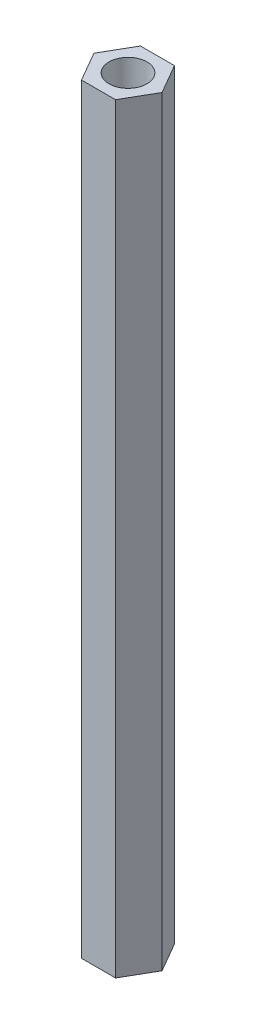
ISO-10303-21;
HEADER;
FILE_DESCRIPTION(('STEP AP214'),'2;1');
FILE_NAME('part.step','',(''),(''),'','','');
FILE_SCHEMA(('AUTOMOTIVE_DESIGN { 1 0 10303 214 1 1 1 1 }'));
ENDSEC;
DATA;
#1=APPLICATION_CONTEXT('core data for automotive mechanical design processes');
#2=APPLICATION_PROTOCOL_DEFINITION('international standard','automotive_design',2000,#1);
#3=PRODUCT_CONTEXT('',#1,'mechanical');
#4=PRODUCT('Part','Part','',(#3));
#5=PRODUCT_RELATED_PRODUCT_CATEGORY('part','',(#4));
#6=PRODUCT_DEFINITION_FORMATION('','',#4);
#7=PRODUCT_DEFINITION_CONTEXT('part definition',#1,'design');
#8=PRODUCT_DEFINITION('design','',#6,#7);
#9=PRODUCT_DEFINITION_SHAPE('','',#8);
#10=(LENGTH_UNIT() NAMED_UNIT(*) SI_UNIT(.MILLI.,.METRE.));
#11=(NAMED_UNIT(*) PLANE_ANGLE_UNIT() SI_UNIT($,.RADIAN.));
#12=(NAMED_UNIT(*) SI_UNIT($,.STERADIAN.) SOLID_ANGLE_UNIT());
#13=UNCERTAINTY_MEASURE_WITH_UNIT(LENGTH_MEASURE(1.E-05),#10,'distance_accuracy_value','');
#14=(GEOMETRIC_REPRESENTATION_CONTEXT(3) GLOBAL_UNCERTAINTY_ASSIGNED_CONTEXT((#13)) GLOBAL_UNIT_ASSIGNED_CONTEXT((#10,
#11,#12)) REPRESENTATION_CONTEXT('',''));
#15=CARTESIAN_POINT('',(0.,0.,0.));
#16=DIRECTION('',(0.,0.,1.));
#17=DIRECTION('',(1.,0.,0.));
#18=AXIS2_PLACEMENT_3D('',#15,#16,#17);
#19=CARTESIAN_POINT('',(0.,80.,0.));
#20=DIRECTION('',(0.,1.,0.));
#21=DIRECTION('',(0.,0.,1.));
#22=AXIS2_PLACEMENT_3D('',#19,#20,#21);
#23=PLANE('',#22);
#24=DIRECTION('',(0.499999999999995,0.,-0.866025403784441));
#25=VECTOR('',#24,1.);
#26=CARTESIAN_POINT('',(1.78978583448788,80.,3.09999999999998));
#27=LINE('',#26,#25);
#28=CARTESIAN_POINT('',(1.78978583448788,80.,3.09999999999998));
#29=VERTEX_POINT('',#28);
#30=CARTESIAN_POINT('',(3.57957166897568,80.,0.));
#31=VERTEX_POINT('',#30);
#32=EDGE_CURVE('E137',#29,#31,#27,.T.);
#33=ORIENTED_EDGE('',*,*,#32,.T.);
#34=DIRECTION('',(-0.500000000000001,0.,-0.866025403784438));
#35=VECTOR('',#34,1.);
#36=CARTESIAN_POINT('',(3.57957166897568,80.,0.));
#37=LINE('',#36,#35);
#38=CARTESIAN_POINT('',(1.78978583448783,80.,-3.10000000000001));
#39=VERTEX_POINT('',#38);
#40=EDGE_CURVE('E95',#31,#39,#37,.T.);
#41=ORIENTED_EDGE('',*,*,#40,.T.);
#42=DIRECTION('',(-1.,0.,0.));
#43=VECTOR('',#42,1.);
#44=CARTESIAN_POINT('',(1.78978583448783,80.,-3.10000000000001));
#45=LINE('',#44,#43);
#46=CARTESIAN_POINT('',(-1.78978583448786,80.,-3.09999999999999));
#47=VERTEX_POINT('',#46);
#48=EDGE_CURVE('E108',#39,#47,#45,.T.);
#49=ORIENTED_EDGE('',*,*,#48,.T.);
#50=DIRECTION('',(-0.499999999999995,0.,0.866025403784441));
#51=VECTOR('',#50,1.);
#52=CARTESIAN_POINT('',(-1.78978583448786,80.,-3.09999999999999));
#53=LINE('',#52,#51);
#54=CARTESIAN_POINT('',(-3.57957166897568,80.,0.));
#55=VERTEX_POINT('',#54);
#56=EDGE_CURVE('E102',#47,#55,#53,.T.);
#57=ORIENTED_EDGE('',*,*,#56,.T.);
#58=DIRECTION('',(0.500000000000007,0.,0.866025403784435));
#59=VECTOR('',#58,1.);
#60=CARTESIAN_POINT('',(-3.57957166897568,80.,0.));
#61=LINE('',#60,#59);
#62=CARTESIAN_POINT('',(-1.78978583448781,80.,3.10000000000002));
#63=VERTEX_POINT('',#62);
#64=EDGE_CURVE('E106',#55,#63,#61,.T.);
#65=ORIENTED_EDGE('',*,*,#64,.T.);
#66=DIRECTION('',(1.,0.,0.));
#67=VECTOR('',#66,1.);
#68=CARTESIAN_POINT('',(-1.78978583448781,80.,3.10000000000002));
#69=LINE('',#68,#67);
#70=EDGE_CURVE('E58',#63,#29,#69,.T.);
#71=ORIENTED_EDGE('',*,*,#70,.T.);
#72=EDGE_LOOP('',(#33,#41,#49,#57,#65,#71));
#73=FACE_BOUND('',#72,.T.);
#74=CARTESIAN_POINT('',(0.,80.,0.));
#75=DIRECTION('',(0.,1.,0.));
#76=DIRECTION('',(0.,0.,1.));
#77=AXIS2_PLACEMENT_3D('',#74,#75,#76);
#78=CIRCLE('',#77,2.);
#79=CARTESIAN_POINT('',(0.,80.,2.));
#80=VERTEX_POINT('',#79);
#81=EDGE_CURVE('E130',#80,#80,#78,.T.);
#82=ORIENTED_EDGE('',*,*,#81,.F.);
#83=EDGE_LOOP('',(#82));
#84=FACE_BOUND('',#83,.T.);
#85=ADVANCED_FACE('F41',(#73,#84),#23,.T.);
#86=CARTESIAN_POINT('',(0.,0.,0.));
#87=DIRECTION('',(0.,1.,0.));
#88=DIRECTION('',(0.,0.,1.));
#89=AXIS2_PLACEMENT_3D('',#86,#87,#88);
#90=PLANE('',#89);
#91=DIRECTION('',(0.499999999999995,0.,-0.866025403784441));
#92=VECTOR('',#91,1.);
#93=CARTESIAN_POINT('',(1.78978583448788,0.,3.09999999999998));
#94=LINE('',#93,#92);
#95=CARTESIAN_POINT('',(1.78978583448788,0.,3.09999999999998));
#96=VERTEX_POINT('',#95);
#97=CARTESIAN_POINT('',(3.57957166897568,0.,0.));
#98=VERTEX_POINT('',#97);
#99=EDGE_CURVE('E126',#96,#98,#94,.T.);
#100=ORIENTED_EDGE('',*,*,#99,.F.);
#101=DIRECTION('',(1.,0.,0.));
#102=VECTOR('',#101,1.);
#103=CARTESIAN_POINT('',(-1.78978583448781,0.,3.10000000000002));
#104=LINE('',#103,#102);
#105=CARTESIAN_POINT('',(-1.78978583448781,0.,3.10000000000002));
#106=VERTEX_POINT('',#105);
#107=EDGE_CURVE('E87',#106,#96,#104,.T.);
#108=ORIENTED_EDGE('',*,*,#107,.F.);
#109=DIRECTION('',(0.500000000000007,0.,0.866025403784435));
#110=VECTOR('',#109,1.);
#111=CARTESIAN_POINT('',(-3.57957166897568,0.,0.));
#112=LINE('',#111,#110);
#113=CARTESIAN_POINT('',(-3.57957166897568,0.,0.));
#114=VERTEX_POINT('',#113);
#115=EDGE_CURVE('E81',#114,#106,#112,.T.);
#116=ORIENTED_EDGE('',*,*,#115,.F.);
#117=DIRECTION('',(-0.499999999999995,0.,0.866025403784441));
#118=VECTOR('',#117,1.);
#119=CARTESIAN_POINT('',(-1.78978583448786,0.,-3.09999999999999));
#120=LINE('',#119,#118);
#121=CARTESIAN_POINT('',(-1.78978583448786,0.,-3.09999999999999));
#122=VERTEX_POINT('',#121);
#123=EDGE_CURVE('E116',#122,#114,#120,.T.);
#124=ORIENTED_EDGE('',*,*,#123,.F.);
#125=DIRECTION('',(-1.,0.,0.));
#126=VECTOR('',#125,1.);
#127=CARTESIAN_POINT('',(1.78978583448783,0.,-3.10000000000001));
#128=LINE('',#127,#126);
#129=CARTESIAN_POINT('',(1.78978583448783,0.,-3.10000000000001));
#130=VERTEX_POINT('',#129);
#131=EDGE_CURVE('E132',#130,#122,#128,.T.);
#132=ORIENTED_EDGE('',*,*,#131,.F.);
#133=DIRECTION('',(-0.500000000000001,0.,-0.866025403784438));
#134=VECTOR('',#133,1.);
#135=CARTESIAN_POINT('',(3.57957166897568,0.,0.));
#136=LINE('',#135,#134);
#137=EDGE_CURVE('E129',#98,#130,#136,.T.);
#138=ORIENTED_EDGE('',*,*,#137,.F.);
#139=EDGE_LOOP('',(#100,#108,#116,#124,#132,#138));
#140=FACE_BOUND('',#139,.T.);
#141=CARTESIAN_POINT('',(0.,0.,0.));
#142=DIRECTION('',(0.,1.,0.));
#143=DIRECTION('',(0.,0.,1.));
#144=AXIS2_PLACEMENT_3D('',#141,#142,#143);
#145=CIRCLE('',#144,2.);
#146=CARTESIAN_POINT('',(0.,0.,2.));
#147=VERTEX_POINT('',#146);
#148=EDGE_CURVE('E230',#147,#147,#145,.T.);
#149=ORIENTED_EDGE('',*,*,#148,.T.);
#150=EDGE_LOOP('',(#149));
#151=FACE_BOUND('',#150,.T.);
#152=ADVANCED_FACE('F146',(#140,#151),#90,.F.);
#153=CARTESIAN_POINT('',(1.78978583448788,80.,3.09999999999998));
#154=DIRECTION('',(-0.866025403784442,0.,-0.499999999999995));
#155=DIRECTION('',(-0.499999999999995,0.,0.866025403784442));
#156=AXIS2_PLACEMENT_3D('',#153,#154,#155);
#157=PLANE('',#156);
#158=ORIENTED_EDGE('',*,*,#99,.T.);
#159=DIRECTION('',(0.,-1.,0.));
#160=VECTOR('',#159,1.);
#161=CARTESIAN_POINT('',(3.57957166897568,80.,0.));
#162=LINE('',#161,#160);
#163=EDGE_CURVE('E11',#31,#98,#162,.T.);
#164=ORIENTED_EDGE('',*,*,#163,.F.);
#165=ORIENTED_EDGE('',*,*,#32,.F.);
#166=DIRECTION('',(0.,-1.,0.));
#167=VECTOR('',#166,1.);
#168=CARTESIAN_POINT('',(1.78978583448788,80.,3.09999999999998));
#169=LINE('',#168,#167);
#170=EDGE_CURVE('E122',#29,#96,#169,.T.);
#171=ORIENTED_EDGE('',*,*,#170,.T.);
#172=EDGE_LOOP('',(#158,#164,#165,#171));
#173=FACE_BOUND('',#172,.T.);
#174=ADVANCED_FACE('F43',(#173),#157,.F.);
#175=CARTESIAN_POINT('',(3.57957166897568,80.,0.));
#176=DIRECTION('',(-0.866025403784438,0.,0.500000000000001));
#177=DIRECTION('',(0.500000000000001,0.,0.866025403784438));
#178=AXIS2_PLACEMENT_3D('',#175,#176,#177);
#179=PLANE('',#178);
#180=ORIENTED_EDGE('',*,*,#137,.T.);
#181=DIRECTION('',(0.,-1.,0.));
#182=VECTOR('',#181,1.);
#183=CARTESIAN_POINT('',(1.78978583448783,80.,-3.10000000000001));
#184=LINE('',#183,#182);
#185=EDGE_CURVE('E50',#39,#130,#184,.T.);
#186=ORIENTED_EDGE('',*,*,#185,.F.);
#187=ORIENTED_EDGE('',*,*,#40,.F.);
#188=ORIENTED_EDGE('',*,*,#163,.T.);
#189=EDGE_LOOP('',(#180,#186,#187,#188));
#190=FACE_BOUND('',#189,.T.);
#191=ADVANCED_FACE('F171',(#190),#179,.F.);
#192=CARTESIAN_POINT('',(1.78978583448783,80.,-3.10000000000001));
#193=DIRECTION('',(0.,0.,1.));
#194=DIRECTION('',(1.,0.,0.));
#195=AXIS2_PLACEMENT_3D('',#192,#193,#194);
#196=PLANE('',#195);
#197=ORIENTED_EDGE('',*,*,#131,.T.);
#198=DIRECTION('',(0.,-1.,0.));
#199=VECTOR('',#198,1.);
#200=CARTESIAN_POINT('',(-1.78978583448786,80.,-3.09999999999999));
#201=LINE('',#200,#199);
#202=EDGE_CURVE('E117',#47,#122,#201,.T.);
#203=ORIENTED_EDGE('',*,*,#202,.F.);
#204=ORIENTED_EDGE('',*,*,#48,.F.);
#205=ORIENTED_EDGE('',*,*,#185,.T.);
#206=EDGE_LOOP('',(#197,#203,#204,#205));
#207=FACE_BOUND('',#206,.T.);
#208=ADVANCED_FACE('F143',(#207),#196,.F.);
#209=CARTESIAN_POINT('',(-1.78978583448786,80.,-3.09999999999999));
#210=DIRECTION('',(0.866025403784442,0.,0.499999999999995));
#211=DIRECTION('',(0.499999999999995,0.,-0.866025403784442));
#212=AXIS2_PLACEMENT_3D('',#209,#210,#211);
#213=PLANE('',#212);
#214=ORIENTED_EDGE('',*,*,#123,.T.);
#215=DIRECTION('',(0.,-1.,0.));
#216=VECTOR('',#215,1.);
#217=CARTESIAN_POINT('',(-3.57957166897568,80.,0.));
#218=LINE('',#217,#216);
#219=EDGE_CURVE('E113',#55,#114,#218,.T.);
#220=ORIENTED_EDGE('',*,*,#219,.F.);
#221=ORIENTED_EDGE('',*,*,#56,.F.);
#222=ORIENTED_EDGE('',*,*,#202,.T.);
#223=EDGE_LOOP('',(#214,#220,#221,#222));
#224=FACE_BOUND('',#223,.T.);
#225=ADVANCED_FACE('F114',(#224),#213,.F.);
#226=CARTESIAN_POINT('',(-3.57957166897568,80.,0.));
#227=DIRECTION('',(0.866025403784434,0.,-0.500000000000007));
#228=DIRECTION('',(-0.500000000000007,0.,-0.866025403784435));
#229=AXIS2_PLACEMENT_3D('',#226,#227,#228);
#230=PLANE('',#229);
#231=ORIENTED_EDGE('',*,*,#115,.T.);
#232=DIRECTION('',(0.,-1.,0.));
#233=VECTOR('',#232,1.);
#234=CARTESIAN_POINT('',(-1.78978583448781,80.,3.10000000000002));
#235=LINE('',#234,#233);
#236=EDGE_CURVE('E118',#63,#106,#235,.T.);
#237=ORIENTED_EDGE('',*,*,#236,.F.);
#238=ORIENTED_EDGE('',*,*,#64,.F.);
#239=ORIENTED_EDGE('',*,*,#219,.T.);
#240=EDGE_LOOP('',(#231,#237,#238,#239));
#241=FACE_BOUND('',#240,.T.);
#242=ADVANCED_FACE('F120',(#241),#230,.F.);
#243=CARTESIAN_POINT('',(-1.78978583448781,80.,3.10000000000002));
#244=DIRECTION('',(0.,0.,-1.));
#245=DIRECTION('',(-1.,0.,0.));
#246=AXIS2_PLACEMENT_3D('',#243,#244,#245);
#247=PLANE('',#246);
#248=ORIENTED_EDGE('',*,*,#107,.T.);
#249=ORIENTED_EDGE('',*,*,#170,.F.);
#250=ORIENTED_EDGE('',*,*,#70,.F.);
#251=ORIENTED_EDGE('',*,*,#236,.T.);
#252=EDGE_LOOP('',(#248,#249,#250,#251));
#253=FACE_BOUND('',#252,.T.);
#254=ADVANCED_FACE('F151',(#253),#247,.F.);
#255=CARTESIAN_POINT('',(0.,80.,0.));
#256=DIRECTION('',(0.,-1.,0.));
#257=DIRECTION('',(0.,0.,-1.));
#258=AXIS2_PLACEMENT_3D('',#255,#256,#257);
#259=CYLINDRICAL_SURFACE('',#258,2.);
#260=ORIENTED_EDGE('',*,*,#81,.T.);
#261=EDGE_LOOP('',(#260));
#262=FACE_BOUND('',#261,.T.);
#263=ORIENTED_EDGE('',*,*,#148,.F.);
#264=EDGE_LOOP('',(#263));
#265=FACE_BOUND('',#264,.T.);
#266=ADVANCED_FACE('F153',(#262,#265),#259,.F.);
#267=CLOSED_SHELL('',(#85,#152,#174,#191,#208,#225,#242,#254,#266));
#268=MANIFOLD_SOLID_BREP('B2',#267);
#269=ADVANCED_BREP_SHAPE_REPRESENTATION('',(#18,#268),#14);
#270=SHAPE_DEFINITION_REPRESENTATION(#9,#269);
ENDSEC;
END-ISO-10303-21;
